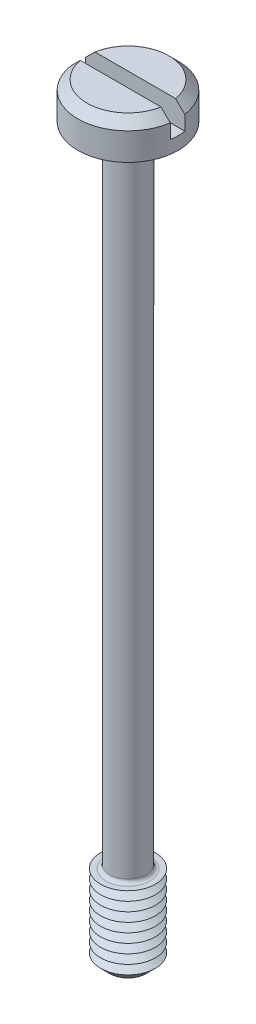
ISO-10303-21;
HEADER;
FILE_DESCRIPTION(('STEP AP214'),'2;1');
FILE_NAME('part.step','',(''),(''),'','','');
FILE_SCHEMA(('AUTOMOTIVE_DESIGN { 1 0 10303 214 1 1 1 1 }'));
ENDSEC;
DATA;
#1=APPLICATION_CONTEXT('core data for automotive mechanical design processes');
#2=APPLICATION_PROTOCOL_DEFINITION('international standard','automotive_design',2000,#1);
#3=PRODUCT_CONTEXT('',#1,'mechanical');
#4=PRODUCT('Part','Part','',(#3));
#5=PRODUCT_RELATED_PRODUCT_CATEGORY('part','',(#4));
#6=PRODUCT_DEFINITION_FORMATION('','',#4);
#7=PRODUCT_DEFINITION_CONTEXT('part definition',#1,'design');
#8=PRODUCT_DEFINITION('design','',#6,#7);
#9=PRODUCT_DEFINITION_SHAPE('','',#8);
#10=(LENGTH_UNIT() NAMED_UNIT(*) SI_UNIT(.MILLI.,.METRE.));
#11=(NAMED_UNIT(*) PLANE_ANGLE_UNIT() SI_UNIT($,.RADIAN.));
#12=(NAMED_UNIT(*) SI_UNIT($,.STERADIAN.) SOLID_ANGLE_UNIT());
#13=UNCERTAINTY_MEASURE_WITH_UNIT(LENGTH_MEASURE(1.E-05),#10,'distance_accuracy_value','');
#14=(GEOMETRIC_REPRESENTATION_CONTEXT(3) GLOBAL_UNCERTAINTY_ASSIGNED_CONTEXT((#13)) GLOBAL_UNIT_ASSIGNED_CONTEXT((#10,
#11,#12)) REPRESENTATION_CONTEXT('',''));
#15=CARTESIAN_POINT('',(0.,0.,0.));
#16=DIRECTION('',(0.,0.,1.));
#17=DIRECTION('',(1.,0.,0.));
#18=AXIS2_PLACEMENT_3D('',#15,#16,#17);
#19=CARTESIAN_POINT('',(0.,2.,0.));
#20=DIRECTION('',(0.,1.,0.));
#21=DIRECTION('',(0.,0.,1.));
#22=AXIS2_PLACEMENT_3D('',#19,#20,#21);
#23=PLANE('',#22);
#24=DIRECTION('',(-1.,0.,0.));
#25=VECTOR('',#24,1.);
#26=CARTESIAN_POINT('',(2.75,2.,-0.4));
#27=LINE('',#26,#25);
#28=CARTESIAN_POINT('',(2.21415898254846,2.,-0.4));
#29=VERTEX_POINT('',#28);
#30=CARTESIAN_POINT('',(-2.21415898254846,2.,-0.4));
#31=VERTEX_POINT('',#30);
#32=EDGE_CURVE('E110',#29,#31,#27,.T.);
#33=ORIENTED_EDGE('',*,*,#32,.F.);
#34=CARTESIAN_POINT('',(0.,2.,0.));
#35=DIRECTION('',(0.,1.,0.));
#36=DIRECTION('',(0.,0.,1.));
#37=AXIS2_PLACEMENT_3D('',#34,#35,#36);
#38=CIRCLE('',#37,2.25000000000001);
#39=EDGE_CURVE('E113',#29,#31,#38,.T.);
#40=ORIENTED_EDGE('',*,*,#39,.T.);
#41=EDGE_LOOP('',(#33,#40));
#42=FACE_BOUND('',#41,.T.);
#43=ADVANCED_FACE('F39',(#42),#23,.T.);
#44=CARTESIAN_POINT('',(0.,2.,0.));
#45=DIRECTION('',(0.,-1.,0.));
#46=DIRECTION('',(0.,0.,-1.));
#47=AXIS2_PLACEMENT_3D('',#44,#45,#46);
#48=CONICAL_SURFACE('',#47,2.25000000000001,0.785398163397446);
#49=CARTESIAN_POINT('',(6.05060089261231,-1.81380830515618,-0.4));
#50=CARTESIAN_POINT('',(5.84217393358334,-1.60583904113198,-0.4));
#51=CARTESIAN_POINT('',(5.63372707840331,-1.39788969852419,-0.4));
#52=CARTESIAN_POINT('',(5.21676338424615,-0.982052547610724,-0.4));
#53=CARTESIAN_POINT('',(5.00824654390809,-0.774164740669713,-0.4));
#54=CARTESIAN_POINT('',(4.59102343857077,-0.358383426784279,-0.4));
#55=CARTESIAN_POINT('',(4.38231713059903,-0.150489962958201,-0.4));
#56=CARTESIAN_POINT('',(3.96477014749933,0.265153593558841,-0.4));
#57=CARTESIAN_POINT('',(3.75592947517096,0.47290368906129,-0.4));
#58=CARTESIAN_POINT('',(3.33589913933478,0.890287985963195,-0.4));
#59=CARTESIAN_POINT('',(3.12470717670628,1.09991987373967,-0.4));
#60=CARTESIAN_POINT('',(2.7019134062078,1.51879562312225,-0.4));
#61=CARTESIAN_POINT('',(2.49031157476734,1.72803946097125,-0.4));
#62=CARTESIAN_POINT('',(2.17231429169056,2.04123939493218,-0.4));
#63=CARTESIAN_POINT('',(2.06623184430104,2.14551302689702,-0.4));
#64=CARTESIAN_POINT('',(1.85373145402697,2.35372301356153,-0.4));
#65=CARTESIAN_POINT('',(1.74731350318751,2.45765936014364,-0.4));
#66=CARTESIAN_POINT('',(1.53394692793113,2.6649644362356,-0.4));
#67=CARTESIAN_POINT('',(1.42699836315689,2.76833322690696,-0.4));
#68=CARTESIAN_POINT('',(1.26580938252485,2.9225823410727,-0.4));
#69=CARTESIAN_POINT('',(1.21195308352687,2.97386371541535,-0.4));
#70=CARTESIAN_POINT('',(1.10386632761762,3.07603025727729,-0.4));
#71=CARTESIAN_POINT('',(1.0496358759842,3.126915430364,-0.4));
#72=CARTESIAN_POINT('',(0.965529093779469,3.20495157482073,-0.4));
#73=CARTESIAN_POINT('',(0.935852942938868,3.23231811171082,-0.4));
#74=CARTESIAN_POINT('',(0.876282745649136,3.2868144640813,-0.4));
#75=CARTESIAN_POINT('',(0.846388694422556,3.31394427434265,-0.4));
#76=CARTESIAN_POINT('',(0.786319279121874,3.36788760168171,-0.4));
#77=CARTESIAN_POINT('',(0.756143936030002,3.39470114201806,-0.4));
#78=CARTESIAN_POINT('',(0.695411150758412,3.44788757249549,-0.4));
#79=CARTESIAN_POINT('',(0.664853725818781,3.47426048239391,-0.4));
#80=CARTESIAN_POINT('',(0.587773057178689,3.53947080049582,-0.4));
#81=CARTESIAN_POINT('',(0.540923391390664,3.57793090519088,-0.4));
#82=CARTESIAN_POINT('',(0.469108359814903,3.63368803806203,-0.4));
#83=CARTESIAN_POINT('',(0.4449029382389,3.65195872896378,-0.4));
#84=CARTESIAN_POINT('',(0.395796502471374,3.68753467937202,-0.4));
#85=CARTESIAN_POINT('',(0.370895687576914,3.70484021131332,-0.4));
#86=CARTESIAN_POINT('',(0.315135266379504,3.74129905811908,-0.4));
#87=CARTESIAN_POINT('',(0.284069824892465,3.76014262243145,-0.4));
#88=CARTESIAN_POINT('',(0.220007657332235,3.79429188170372,-0.4));
#89=CARTESIAN_POINT('',(0.187014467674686,3.80960381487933,-0.4));
#90=CARTESIAN_POINT('',(0.12946932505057,3.83013103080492,-0.4));
#91=CARTESIAN_POINT('',(0.105533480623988,3.83700748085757,-0.4));
#92=CARTESIAN_POINT('',(0.056886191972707,3.84667143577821,-0.4));
#93=CARTESIAN_POINT('',(0.032177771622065,3.84947323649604,-0.4));
#94=CARTESIAN_POINT('',(-0.017455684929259,3.85039131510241,-0.4));
#95=CARTESIAN_POINT('',(-0.0423811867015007,3.84848412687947,-0.4));
#96=CARTESIAN_POINT('',(-0.091546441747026,3.8403829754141,-0.4));
#97=CARTESIAN_POINT('',(-0.11578417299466,3.83417751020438,-0.4));
#98=CARTESIAN_POINT('',(-0.164015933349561,3.81830420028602,-0.4));
#99=CARTESIAN_POINT('',(-0.187969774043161,3.80851974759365,-0.4));
#100=CARTESIAN_POINT('',(-0.234812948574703,3.78663483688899,-0.4));
#101=CARTESIAN_POINT('',(-0.257700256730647,3.77453017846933,-0.4));
#102=CARTESIAN_POINT('',(-0.3027615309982,3.74868049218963,-0.4));
#103=CARTESIAN_POINT('',(-0.324928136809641,3.73492286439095,-0.4));
#104=CARTESIAN_POINT('',(-0.36853632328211,3.70635481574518,-0.4));
#105=CARTESIAN_POINT('',(-0.389978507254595,3.691545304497,-0.4));
#106=CARTESIAN_POINT('',(-0.457169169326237,3.64340388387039,-0.4));
#107=CARTESIAN_POINT('',(-0.501937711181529,3.60871473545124,-0.4));
#108=CARTESIAN_POINT('',(-0.590074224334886,3.53759028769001,-0.4));
#109=CARTESIAN_POINT('',(-0.633441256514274,3.50115385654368,-0.4));
#110=CARTESIAN_POINT('',(-0.719371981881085,3.42718980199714,-0.4));
#111=CARTESIAN_POINT('',(-0.761934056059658,3.3896603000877,-0.4));
#112=CARTESIAN_POINT('',(-0.84646547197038,3.31396862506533,-0.4));
#113=CARTESIAN_POINT('',(-0.888434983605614,3.27580664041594,-0.4));
#114=CARTESIAN_POINT('',(-1.01351008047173,3.16091722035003,-0.4));
#115=CARTESIAN_POINT('',(-1.09603733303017,3.0835613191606,-0.4));
#116=CARTESIAN_POINT('',(-1.26020205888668,2.92809304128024,-0.4));
#117=CARTESIAN_POINT('',(-1.34184039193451,2.84998156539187,-0.4));
#118=CARTESIAN_POINT('',(-1.50425180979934,2.69362860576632,-0.4));
#119=CARTESIAN_POINT('',(-1.58502715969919,2.61538947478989,-0.4));
#120=CARTESIAN_POINT('',(-1.74627332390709,2.45859784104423,-0.4));
#121=CARTESIAN_POINT('',(-1.82674413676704,2.38004533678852,-0.4));
#122=CARTESIAN_POINT('',(-2.06785619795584,2.14407469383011,-0.4));
#123=CARTESIAN_POINT('',(-2.22819388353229,1.98634651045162,-0.4));
#124=CARTESIAN_POINT('',(-2.54852691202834,1.67040441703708,-0.4));
#125=CARTESIAN_POINT('',(-2.70852207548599,1.51219032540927,-0.4));
#126=CARTESIAN_POINT('',(-3.02826273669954,1.19551306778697,-0.4));
#127=CARTESIAN_POINT('',(-3.18800823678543,1.03704990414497,-0.4));
#128=CARTESIAN_POINT('',(-3.66699080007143,0.561455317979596,-0.4));
#129=CARTESIAN_POINT('',(-3.98599924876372,0.244093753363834,-0.4));
#130=CARTESIAN_POINT('',(-4.62369880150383,-0.390879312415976,-0.4));
#131=CARTESIAN_POINT('',(-4.94238993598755,-0.708490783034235,-0.4));
#132=CARTESIAN_POINT('',(-5.39262624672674,-1.15743192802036,-0.4));
#133=CARTESIAN_POINT('',(-5.52423897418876,-1.28869385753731,-0.4));
#134=CARTESIAN_POINT('',(-5.78743776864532,-1.5512369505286,-0.4));
#135=CARTESIAN_POINT('',(-5.91902383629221,-1.68251811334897,-0.4));
#136=CARTESIAN_POINT('',(-6.05060089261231,-1.81380830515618,-0.4));
#137=B_SPLINE_CURVE_WITH_KNOTS('',3,(#49,#50,#51,#52,#53,#54,#55,#56,#57,#58,#59,#60,#61,#62,
#63,#64,#65,#66,#67,#68,#69,#70,#71,#72,#73,#74,#75,#76,#77,#78,#79,#80,#81,#82,#83,#84,#85,#86,
#87,#88,#89,#90,#91,#92,#93,#94,#95,#96,#97,#98,#99,#100,#101,#102,#103,#104,#105,#106,#107,
#108,#109,#110,#111,#112,#113,#114,#115,#116,#117,#118,#119,#120,#121,#122,#123,#124,#125,#126,
#127,#128,#129,#130,#131,#132,#133,#134,#135,#136),.UNSPECIFIED.,.F.,.F.,(4,2,2,2,2,2,2,2,2,2,2,
2,2,2,2,2,2,2,2,2,2,2,2,2,2,2,2,2,2,2,2,2,2,2,2,2,2,2,2,2,2,2,2,4),(0.,0.883310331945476,
1.76663897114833,2.65038219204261,3.53410755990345,4.42681573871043,5.31957687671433,
5.76582544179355,6.21208466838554,6.65829482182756,6.88139126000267,7.10448455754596,
7.22558850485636,7.34669511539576,7.46779276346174,7.58888496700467,7.77066509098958,
7.86163037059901,7.95256984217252,8.06146372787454,8.17016376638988,8.24461141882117,
8.31879723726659,8.39335348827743,8.46811002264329,8.54555790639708,8.62314734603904,
8.70137101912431,8.77952785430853,8.94932745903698,9.1192385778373,9.28946128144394,
9.45963414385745,9.79895964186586,10.1379210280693,10.475282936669,10.8126464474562,
11.4873867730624,12.1624208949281,12.8374486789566,14.1873973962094,15.5372009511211,
16.0948428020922,16.6524687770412),.UNSPECIFIED.);
#138=CARTESIAN_POINT('',(2.72075357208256,1.5,-0.4));
#139=VERTEX_POINT('',#138);
#140=EDGE_CURVE('E259',#139,#29,#137,.T.);
#141=ORIENTED_EDGE('',*,*,#140,.F.);
#142=CARTESIAN_POINT('',(0.,1.5,0.));
#143=DIRECTION('',(0.,1.,0.));
#144=DIRECTION('',(0.,0.,1.));
#145=AXIS2_PLACEMENT_3D('',#142,#143,#144);
#146=CIRCLE('',#145,2.75);
#147=CARTESIAN_POINT('',(-2.72075357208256,1.5,-0.4));
#148=VERTEX_POINT('',#147);
#149=EDGE_CURVE('E127',#148,#139,#146,.F.);
#150=ORIENTED_EDGE('',*,*,#149,.F.);
#151=EDGE_CURVE('E102',#31,#148,#137,.T.);
#152=ORIENTED_EDGE('',*,*,#151,.F.);
#153=ORIENTED_EDGE('',*,*,#39,.F.);
#154=EDGE_LOOP('',(#141,#150,#152,#153));
#155=FACE_BOUND('',#154,.T.);
#156=ADVANCED_FACE('F221',(#155),#48,.T.);
#157=CARTESIAN_POINT('',(0.,-40.,0.));
#158=DIRECTION('',(0.,1.,0.));
#159=DIRECTION('',(0.,0.,1.));
#160=AXIS2_PLACEMENT_3D('',#157,#158,#159);
#161=CYLINDRICAL_SURFACE('',#160,1.);
#162=CARTESIAN_POINT('',(0.,-35.3,0.));
#163=DIRECTION('',(0.,-1.,0.));
#164=DIRECTION('',(0.,0.,-1.));
#165=AXIS2_PLACEMENT_3D('',#162,#163,#164);
#166=CIRCLE('',#165,1.);
#167=CARTESIAN_POINT('',(0.,-35.3,-1.));
#168=VERTEX_POINT('',#167);
#169=EDGE_CURVE('E122',#168,#168,#166,.F.);
#170=ORIENTED_EDGE('',*,*,#169,.T.);
#171=EDGE_LOOP('',(#170));
#172=FACE_BOUND('',#171,.T.);
#173=CARTESIAN_POINT('',(0.,-0.199999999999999,0.));
#174=DIRECTION('',(0.,1.,0.));
#175=DIRECTION('',(0.,0.,1.));
#176=AXIS2_PLACEMENT_3D('',#173,#174,#175);
#177=CIRCLE('',#176,1.);
#178=CARTESIAN_POINT('',(0.,-0.199999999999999,1.));
#179=VERTEX_POINT('',#178);
#180=EDGE_CURVE('E366',#179,#179,#177,.F.);
#181=ORIENTED_EDGE('',*,*,#180,.T.);
#182=EDGE_LOOP('',(#181));
#183=FACE_BOUND('',#182,.T.);
#184=ADVANCED_FACE('F217',(#172,#183),#161,.T.);
#185=CARTESIAN_POINT('',(0.,2.,0.));
#186=DIRECTION('',(0.,-1.,0.));
#187=DIRECTION('',(0.,0.,-1.));
#188=AXIS2_PLACEMENT_3D('',#185,#186,#187);
#189=CYLINDRICAL_SURFACE('',#188,2.75);
#190=ORIENTED_EDGE('',*,*,#149,.T.);
#191=DIRECTION('',(0.,-1.,0.));
#192=VECTOR('',#191,1.);
#193=CARTESIAN_POINT('',(2.72075357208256,2.,-0.4));
#194=LINE('',#193,#192);
#195=CARTESIAN_POINT('',(2.72075357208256,0.7,-0.4));
#196=VERTEX_POINT('',#195);
#197=EDGE_CURVE('E64',#139,#196,#194,.T.);
#198=ORIENTED_EDGE('',*,*,#197,.T.);
#199=CARTESIAN_POINT('',(0.,0.7,0.));
#200=DIRECTION('',(0.,1.,0.));
#201=DIRECTION('',(0.,0.,1.));
#202=AXIS2_PLACEMENT_3D('',#199,#200,#201);
#203=CIRCLE('',#202,2.75);
#204=CARTESIAN_POINT('',(2.72075357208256,0.7,0.4));
#205=VERTEX_POINT('',#204);
#206=EDGE_CURVE('E11',#205,#196,#203,.T.);
#207=ORIENTED_EDGE('',*,*,#206,.F.);
#208=DIRECTION('',(0.,-1.,0.));
#209=VECTOR('',#208,1.);
#210=CARTESIAN_POINT('',(2.72075357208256,2.,0.4));
#211=LINE('',#210,#209);
#212=CARTESIAN_POINT('',(2.72075357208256,1.5,0.4));
#213=VERTEX_POINT('',#212);
#214=EDGE_CURVE('E277',#205,#213,#211,.F.);
#215=ORIENTED_EDGE('',*,*,#214,.T.);
#216=CARTESIAN_POINT('',(-2.72075357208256,1.5,0.4));
#217=VERTEX_POINT('',#216);
#218=EDGE_CURVE('E120',#213,#217,#146,.F.);
#219=ORIENTED_EDGE('',*,*,#218,.T.);
#220=DIRECTION('',(0.,-1.,0.));
#221=VECTOR('',#220,1.);
#222=CARTESIAN_POINT('',(-2.72075357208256,2.,0.4));
#223=LINE('',#222,#221);
#224=CARTESIAN_POINT('',(-2.72075357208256,0.7,0.4));
#225=VERTEX_POINT('',#224);
#226=EDGE_CURVE('E96',#217,#225,#223,.T.);
#227=ORIENTED_EDGE('',*,*,#226,.T.);
#228=CARTESIAN_POINT('',(-2.72075357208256,0.7,-0.4));
#229=VERTEX_POINT('',#228);
#230=EDGE_CURVE('E44',#229,#225,#203,.T.);
#231=ORIENTED_EDGE('',*,*,#230,.F.);
#232=DIRECTION('',(0.,-1.,0.));
#233=VECTOR('',#232,1.);
#234=CARTESIAN_POINT('',(-2.72075357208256,2.,-0.4));
#235=LINE('',#234,#233);
#236=EDGE_CURVE('E282',#229,#148,#235,.F.);
#237=ORIENTED_EDGE('',*,*,#236,.T.);
#238=EDGE_LOOP('',(#190,#198,#207,#215,#219,#227,#231,#237));
#239=FACE_BOUND('',#238,.T.);
#240=CARTESIAN_POINT('',(0.,0.,0.));
#241=DIRECTION('',(0.,1.,0.));
#242=DIRECTION('',(0.,0.,1.));
#243=AXIS2_PLACEMENT_3D('',#240,#241,#242);
#244=CIRCLE('',#243,2.75);
#245=CARTESIAN_POINT('',(0.,0.,2.75));
#246=VERTEX_POINT('',#245);
#247=EDGE_CURVE('E355',#246,#246,#244,.T.);
#248=ORIENTED_EDGE('',*,*,#247,.T.);
#249=EDGE_LOOP('',(#248));
#250=FACE_BOUND('',#249,.T.);
#251=ADVANCED_FACE('F220',(#239,#250),#189,.T.);
#252=DIRECTION('',(1.,0.,0.));
#253=VECTOR('',#252,1.);
#254=CARTESIAN_POINT('',(2.75,2.,0.4));
#255=LINE('',#254,#253);
#256=CARTESIAN_POINT('',(-2.21415898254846,2.,0.4));
#257=VERTEX_POINT('',#256);
#258=CARTESIAN_POINT('',(2.21415898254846,2.,0.4));
#259=VERTEX_POINT('',#258);
#260=EDGE_CURVE('E56',#257,#259,#255,.T.);
#261=ORIENTED_EDGE('',*,*,#260,.F.);
#262=EDGE_CURVE('E108',#257,#259,#38,.T.);
#263=ORIENTED_EDGE('',*,*,#262,.T.);
#264=EDGE_LOOP('',(#261,#263));
#265=FACE_BOUND('',#264,.T.);
#266=ADVANCED_FACE('F107',(#265),#23,.T.);
#267=CARTESIAN_POINT('',(0.,0.,0.));
#268=DIRECTION('',(0.,1.,0.));
#269=DIRECTION('',(0.,0.,1.));
#270=AXIS2_PLACEMENT_3D('',#267,#268,#269);
#271=PLANE('',#270);
#272=CARTESIAN_POINT('',(0.,0.,0.));
#273=DIRECTION('',(0.,1.,0.));
#274=DIRECTION('',(0.,0.,1.));
#275=AXIS2_PLACEMENT_3D('',#272,#273,#274);
#276=CIRCLE('',#275,1.2);
#277=CARTESIAN_POINT('',(0.,0.,1.2));
#278=VERTEX_POINT('',#277);
#279=EDGE_CURVE('E114',#278,#278,#276,.T.);
#280=ORIENTED_EDGE('',*,*,#279,.T.);
#281=EDGE_LOOP('',(#280));
#282=FACE_BOUND('',#281,.T.);
#283=ORIENTED_EDGE('',*,*,#247,.F.);
#284=EDGE_LOOP('',(#283));
#285=FACE_BOUND('',#284,.T.);
#286=ADVANCED_FACE('F211',(#282,#285),#271,.F.);
#287=CARTESIAN_POINT('',(0.,-35.5,0.));
#288=DIRECTION('',(0.,-1.,0.));
#289=DIRECTION('',(0.,0.,-1.));
#290=AXIS2_PLACEMENT_3D('',#287,#288,#289);
#291=PLANE('',#290);
#292=CARTESIAN_POINT('',(0.,-35.5,0.));
#293=DIRECTION('',(0.,-1.,0.));
#294=DIRECTION('',(0.,0.,-1.));
#295=AXIS2_PLACEMENT_3D('',#292,#293,#294);
#296=CIRCLE('',#295,1.2);
#297=CARTESIAN_POINT('',(0.,-35.5,-1.2));
#298=VERTEX_POINT('',#297);
#299=EDGE_CURVE('E362',#298,#298,#296,.T.);
#300=ORIENTED_EDGE('',*,*,#299,.T.);
#301=EDGE_LOOP('',(#300));
#302=FACE_BOUND('',#301,.T.);
#303=CARTESIAN_POINT('',(0.,-35.5,0.));
#304=DIRECTION('',(0.,1.,0.));
#305=DIRECTION('',(0.,0.,1.));
#306=AXIS2_PLACEMENT_3D('',#303,#304,#305);
#307=CIRCLE('',#306,1.5);
#308=CARTESIAN_POINT('',(0.,-35.5,1.5));
#309=VERTEX_POINT('',#308);
#310=EDGE_CURVE('E351',#309,#309,#307,.T.);
#311=ORIENTED_EDGE('',*,*,#310,.T.);
#312=EDGE_LOOP('',(#311));
#313=FACE_BOUND('',#312,.T.);
#314=ADVANCED_FACE('F207',(#302,#313),#291,.F.);
#315=CARTESIAN_POINT('',(0.,-35.75,0.));
#316=DIRECTION('',(0.,1.,0.));
#317=DIRECTION('',(0.,0.,1.));
#318=AXIS2_PLACEMENT_3D('',#315,#316,#317);
#319=CONICAL_SURFACE('',#318,1.06698729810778,1.0471975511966);
#320=ORIENTED_EDGE('',*,*,#310,.F.);
#321=EDGE_LOOP('',(#320));
#322=FACE_BOUND('',#321,.T.);
#323=CARTESIAN_POINT('',(0.,-35.75,0.));
#324=DIRECTION('',(0.,1.,0.));
#325=DIRECTION('',(0.,0.,1.));
#326=AXIS2_PLACEMENT_3D('',#323,#324,#325);
#327=CIRCLE('',#326,1.06698729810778);
#328=CARTESIAN_POINT('',(0.,-35.75,1.06698729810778));
#329=VERTEX_POINT('',#328);
#330=EDGE_CURVE('E348',#329,#329,#327,.T.);
#331=ORIENTED_EDGE('',*,*,#330,.T.);
#332=EDGE_LOOP('',(#331));
#333=FACE_BOUND('',#332,.T.);
#334=ADVANCED_FACE('F203',(#322,#333),#319,.T.);
#335=CARTESIAN_POINT('',(0.,-36.,0.));
#336=DIRECTION('',(0.,-1.,0.));
#337=DIRECTION('',(0.,0.,-1.));
#338=AXIS2_PLACEMENT_3D('',#335,#336,#337);
#339=CONICAL_SURFACE('',#338,1.5,1.0471975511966);
#340=ORIENTED_EDGE('',*,*,#330,.F.);
#341=EDGE_LOOP('',(#340));
#342=FACE_BOUND('',#341,.T.);
#343=CARTESIAN_POINT('',(0.,-36.,0.));
#344=DIRECTION('',(0.,1.,0.));
#345=DIRECTION('',(0.,0.,1.));
#346=AXIS2_PLACEMENT_3D('',#343,#344,#345);
#347=CIRCLE('',#346,1.5);
#348=CARTESIAN_POINT('',(0.,-36.,1.5));
#349=VERTEX_POINT('',#348);
#350=EDGE_CURVE('E345',#349,#349,#347,.T.);
#351=ORIENTED_EDGE('',*,*,#350,.T.);
#352=EDGE_LOOP('',(#351));
#353=FACE_BOUND('',#352,.T.);
#354=ADVANCED_FACE('F199',(#342,#353),#339,.T.);
#355=CARTESIAN_POINT('',(0.,-36.25,0.));
#356=DIRECTION('',(0.,1.,0.));
#357=DIRECTION('',(0.,0.,1.));
#358=AXIS2_PLACEMENT_3D('',#355,#356,#357);
#359=CONICAL_SURFACE('',#358,1.06698729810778,1.0471975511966);
#360=ORIENTED_EDGE('',*,*,#350,.F.);
#361=EDGE_LOOP('',(#360));
#362=FACE_BOUND('',#361,.T.);
#363=CARTESIAN_POINT('',(0.,-36.25,0.));
#364=DIRECTION('',(0.,1.,0.));
#365=DIRECTION('',(0.,0.,1.));
#366=AXIS2_PLACEMENT_3D('',#363,#364,#365);
#367=CIRCLE('',#366,1.06698729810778);
#368=CARTESIAN_POINT('',(0.,-36.25,1.06698729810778));
#369=VERTEX_POINT('',#368);
#370=EDGE_CURVE('E341',#369,#369,#367,.T.);
#371=ORIENTED_EDGE('',*,*,#370,.T.);
#372=EDGE_LOOP('',(#371));
#373=FACE_BOUND('',#372,.T.);
#374=ADVANCED_FACE('F195',(#362,#373),#359,.T.);
#375=CARTESIAN_POINT('',(0.,-36.5,0.));
#376=DIRECTION('',(0.,-1.,0.));
#377=DIRECTION('',(0.,0.,-1.));
#378=AXIS2_PLACEMENT_3D('',#375,#376,#377);
#379=CONICAL_SURFACE('',#378,1.5,1.0471975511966);
#380=ORIENTED_EDGE('',*,*,#370,.F.);
#381=EDGE_LOOP('',(#380));
#382=FACE_BOUND('',#381,.T.);
#383=CARTESIAN_POINT('',(0.,-36.5,0.));
#384=DIRECTION('',(0.,1.,0.));
#385=DIRECTION('',(0.,0.,1.));
#386=AXIS2_PLACEMENT_3D('',#383,#384,#385);
#387=CIRCLE('',#386,1.5);
#388=CARTESIAN_POINT('',(0.,-36.5,1.5));
#389=VERTEX_POINT('',#388);
#390=EDGE_CURVE('E337',#389,#389,#387,.T.);
#391=ORIENTED_EDGE('',*,*,#390,.T.);
#392=EDGE_LOOP('',(#391));
#393=FACE_BOUND('',#392,.T.);
#394=ADVANCED_FACE('F191',(#382,#393),#379,.T.);
#395=CARTESIAN_POINT('',(0.,-36.75,0.));
#396=DIRECTION('',(0.,1.,0.));
#397=DIRECTION('',(0.,0.,1.));
#398=AXIS2_PLACEMENT_3D('',#395,#396,#397);
#399=CONICAL_SURFACE('',#398,1.06698729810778,1.0471975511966);
#400=ORIENTED_EDGE('',*,*,#390,.F.);
#401=EDGE_LOOP('',(#400));
#402=FACE_BOUND('',#401,.T.);
#403=CARTESIAN_POINT('',(0.,-36.75,0.));
#404=DIRECTION('',(0.,1.,0.));
#405=DIRECTION('',(0.,0.,1.));
#406=AXIS2_PLACEMENT_3D('',#403,#404,#405);
#407=CIRCLE('',#406,1.06698729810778);
#408=CARTESIAN_POINT('',(0.,-36.75,1.06698729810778));
#409=VERTEX_POINT('',#408);
#410=EDGE_CURVE('E333',#409,#409,#407,.T.);
#411=ORIENTED_EDGE('',*,*,#410,.T.);
#412=EDGE_LOOP('',(#411));
#413=FACE_BOUND('',#412,.T.);
#414=ADVANCED_FACE('F187',(#402,#413),#399,.T.);
#415=CARTESIAN_POINT('',(0.,-37.,0.));
#416=DIRECTION('',(0.,-1.,0.));
#417=DIRECTION('',(0.,0.,-1.));
#418=AXIS2_PLACEMENT_3D('',#415,#416,#417);
#419=CONICAL_SURFACE('',#418,1.5,1.0471975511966);
#420=ORIENTED_EDGE('',*,*,#410,.F.);
#421=EDGE_LOOP('',(#420));
#422=FACE_BOUND('',#421,.T.);
#423=CARTESIAN_POINT('',(0.,-37.,0.));
#424=DIRECTION('',(0.,1.,0.));
#425=DIRECTION('',(0.,0.,1.));
#426=AXIS2_PLACEMENT_3D('',#423,#424,#425);
#427=CIRCLE('',#426,1.5);
#428=CARTESIAN_POINT('',(0.,-37.,1.5));
#429=VERTEX_POINT('',#428);
#430=EDGE_CURVE('E330',#429,#429,#427,.T.);
#431=ORIENTED_EDGE('',*,*,#430,.T.);
#432=EDGE_LOOP('',(#431));
#433=FACE_BOUND('',#432,.T.);
#434=ADVANCED_FACE('F183',(#422,#433),#419,.T.);
#435=CARTESIAN_POINT('',(0.,-37.25,0.));
#436=DIRECTION('',(0.,1.,0.));
#437=DIRECTION('',(0.,0.,1.));
#438=AXIS2_PLACEMENT_3D('',#435,#436,#437);
#439=CONICAL_SURFACE('',#438,1.06698729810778,1.0471975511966);
#440=ORIENTED_EDGE('',*,*,#430,.F.);
#441=EDGE_LOOP('',(#440));
#442=FACE_BOUND('',#441,.T.);
#443=CARTESIAN_POINT('',(0.,-37.25,0.));
#444=DIRECTION('',(0.,1.,0.));
#445=DIRECTION('',(0.,0.,1.));
#446=AXIS2_PLACEMENT_3D('',#443,#444,#445);
#447=CIRCLE('',#446,1.06698729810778);
#448=CARTESIAN_POINT('',(0.,-37.25,1.06698729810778));
#449=VERTEX_POINT('',#448);
#450=EDGE_CURVE('E326',#449,#449,#447,.T.);
#451=ORIENTED_EDGE('',*,*,#450,.T.);
#452=EDGE_LOOP('',(#451));
#453=FACE_BOUND('',#452,.T.);
#454=ADVANCED_FACE('F179',(#442,#453),#439,.T.);
#455=CARTESIAN_POINT('',(0.,-37.5,0.));
#456=DIRECTION('',(0.,-1.,0.));
#457=DIRECTION('',(0.,0.,-1.));
#458=AXIS2_PLACEMENT_3D('',#455,#456,#457);
#459=CONICAL_SURFACE('',#458,1.5,1.0471975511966);
#460=ORIENTED_EDGE('',*,*,#450,.F.);
#461=EDGE_LOOP('',(#460));
#462=FACE_BOUND('',#461,.T.);
#463=CARTESIAN_POINT('',(0.,-37.5,0.));
#464=DIRECTION('',(0.,1.,0.));
#465=DIRECTION('',(0.,0.,1.));
#466=AXIS2_PLACEMENT_3D('',#463,#464,#465);
#467=CIRCLE('',#466,1.5);
#468=CARTESIAN_POINT('',(0.,-37.5,1.5));
#469=VERTEX_POINT('',#468);
#470=EDGE_CURVE('E323',#469,#469,#467,.T.);
#471=ORIENTED_EDGE('',*,*,#470,.T.);
#472=EDGE_LOOP('',(#471));
#473=FACE_BOUND('',#472,.T.);
#474=ADVANCED_FACE('F175',(#462,#473),#459,.T.);
#475=CARTESIAN_POINT('',(0.,-37.75,0.));
#476=DIRECTION('',(0.,1.,0.));
#477=DIRECTION('',(0.,0.,1.));
#478=AXIS2_PLACEMENT_3D('',#475,#476,#477);
#479=CONICAL_SURFACE('',#478,1.06698729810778,1.0471975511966);
#480=ORIENTED_EDGE('',*,*,#470,.F.);
#481=EDGE_LOOP('',(#480));
#482=FACE_BOUND('',#481,.T.);
#483=CARTESIAN_POINT('',(0.,-37.75,0.));
#484=DIRECTION('',(0.,1.,0.));
#485=DIRECTION('',(0.,0.,1.));
#486=AXIS2_PLACEMENT_3D('',#483,#484,#485);
#487=CIRCLE('',#486,1.06698729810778);
#488=CARTESIAN_POINT('',(0.,-37.75,1.06698729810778));
#489=VERTEX_POINT('',#488);
#490=EDGE_CURVE('E319',#489,#489,#487,.T.);
#491=ORIENTED_EDGE('',*,*,#490,.T.);
#492=EDGE_LOOP('',(#491));
#493=FACE_BOUND('',#492,.T.);
#494=ADVANCED_FACE('F171',(#482,#493),#479,.T.);
#495=CARTESIAN_POINT('',(0.,-38.,0.));
#496=DIRECTION('',(0.,-1.,0.));
#497=DIRECTION('',(0.,0.,-1.));
#498=AXIS2_PLACEMENT_3D('',#495,#496,#497);
#499=CONICAL_SURFACE('',#498,1.5,1.0471975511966);
#500=ORIENTED_EDGE('',*,*,#490,.F.);
#501=EDGE_LOOP('',(#500));
#502=FACE_BOUND('',#501,.T.);
#503=CARTESIAN_POINT('',(0.,-38.,0.));
#504=DIRECTION('',(0.,1.,0.));
#505=DIRECTION('',(0.,0.,1.));
#506=AXIS2_PLACEMENT_3D('',#503,#504,#505);
#507=CIRCLE('',#506,1.5);
#508=CARTESIAN_POINT('',(0.,-38.,1.5));
#509=VERTEX_POINT('',#508);
#510=EDGE_CURVE('E315',#509,#509,#507,.T.);
#511=ORIENTED_EDGE('',*,*,#510,.T.);
#512=EDGE_LOOP('',(#511));
#513=FACE_BOUND('',#512,.T.);
#514=ADVANCED_FACE('F167',(#502,#513),#499,.T.);
#515=CARTESIAN_POINT('',(0.,-38.25,0.));
#516=DIRECTION('',(0.,1.,0.));
#517=DIRECTION('',(0.,0.,1.));
#518=AXIS2_PLACEMENT_3D('',#515,#516,#517);
#519=CONICAL_SURFACE('',#518,1.06698729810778,1.0471975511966);
#520=ORIENTED_EDGE('',*,*,#510,.F.);
#521=EDGE_LOOP('',(#520));
#522=FACE_BOUND('',#521,.T.);
#523=CARTESIAN_POINT('',(0.,-38.25,0.));
#524=DIRECTION('',(0.,1.,0.));
#525=DIRECTION('',(0.,0.,1.));
#526=AXIS2_PLACEMENT_3D('',#523,#524,#525);
#527=CIRCLE('',#526,1.06698729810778);
#528=CARTESIAN_POINT('',(0.,-38.25,1.06698729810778));
#529=VERTEX_POINT('',#528);
#530=EDGE_CURVE('E311',#529,#529,#527,.T.);
#531=ORIENTED_EDGE('',*,*,#530,.T.);
#532=EDGE_LOOP('',(#531));
#533=FACE_BOUND('',#532,.T.);
#534=ADVANCED_FACE('F163',(#522,#533),#519,.T.);
#535=CARTESIAN_POINT('',(0.,-38.5,0.));
#536=DIRECTION('',(0.,-1.,0.));
#537=DIRECTION('',(0.,0.,-1.));
#538=AXIS2_PLACEMENT_3D('',#535,#536,#537);
#539=CONICAL_SURFACE('',#538,1.5,1.0471975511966);
#540=ORIENTED_EDGE('',*,*,#530,.F.);
#541=EDGE_LOOP('',(#540));
#542=FACE_BOUND('',#541,.T.);
#543=CARTESIAN_POINT('',(0.,-38.5,0.));
#544=DIRECTION('',(0.,1.,0.));
#545=DIRECTION('',(0.,0.,1.));
#546=AXIS2_PLACEMENT_3D('',#543,#544,#545);
#547=CIRCLE('',#546,1.5);
#548=CARTESIAN_POINT('',(0.,-38.5,1.5));
#549=VERTEX_POINT('',#548);
#550=EDGE_CURVE('E307',#549,#549,#547,.T.);
#551=ORIENTED_EDGE('',*,*,#550,.T.);
#552=EDGE_LOOP('',(#551));
#553=FACE_BOUND('',#552,.T.);
#554=ADVANCED_FACE('F159',(#542,#553),#539,.T.);
#555=CARTESIAN_POINT('',(0.,-38.75,0.));
#556=DIRECTION('',(0.,1.,0.));
#557=DIRECTION('',(0.,0.,1.));
#558=AXIS2_PLACEMENT_3D('',#555,#556,#557);
#559=CONICAL_SURFACE('',#558,1.06698729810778,1.0471975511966);
#560=ORIENTED_EDGE('',*,*,#550,.F.);
#561=EDGE_LOOP('',(#560));
#562=FACE_BOUND('',#561,.T.);
#563=CARTESIAN_POINT('',(0.,-38.75,0.));
#564=DIRECTION('',(0.,1.,0.));
#565=DIRECTION('',(0.,0.,1.));
#566=AXIS2_PLACEMENT_3D('',#563,#564,#565);
#567=CIRCLE('',#566,1.06698729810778);
#568=CARTESIAN_POINT('',(0.,-38.75,1.06698729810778));
#569=VERTEX_POINT('',#568);
#570=EDGE_CURVE('E303',#569,#569,#567,.T.);
#571=ORIENTED_EDGE('',*,*,#570,.T.);
#572=EDGE_LOOP('',(#571));
#573=FACE_BOUND('',#572,.T.);
#574=ADVANCED_FACE('F155',(#562,#573),#559,.T.);
#575=CARTESIAN_POINT('',(0.,-39.,0.));
#576=DIRECTION('',(0.,-1.,0.));
#577=DIRECTION('',(0.,0.,-1.));
#578=AXIS2_PLACEMENT_3D('',#575,#576,#577);
#579=CONICAL_SURFACE('',#578,1.5,1.0471975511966);
#580=ORIENTED_EDGE('',*,*,#570,.F.);
#581=EDGE_LOOP('',(#580));
#582=FACE_BOUND('',#581,.T.);
#583=CARTESIAN_POINT('',(0.,-39.,0.));
#584=DIRECTION('',(0.,1.,0.));
#585=DIRECTION('',(0.,0.,1.));
#586=AXIS2_PLACEMENT_3D('',#583,#584,#585);
#587=CIRCLE('',#586,1.5);
#588=CARTESIAN_POINT('',(0.,-39.,1.5));
#589=VERTEX_POINT('',#588);
#590=EDGE_CURVE('E299',#589,#589,#587,.T.);
#591=ORIENTED_EDGE('',*,*,#590,.T.);
#592=EDGE_LOOP('',(#591));
#593=FACE_BOUND('',#592,.T.);
#594=ADVANCED_FACE('F151',(#582,#593),#579,.T.);
#595=CARTESIAN_POINT('',(0.,-39.25,0.));
#596=DIRECTION('',(0.,1.,0.));
#597=DIRECTION('',(0.,0.,1.));
#598=AXIS2_PLACEMENT_3D('',#595,#596,#597);
#599=CONICAL_SURFACE('',#598,1.06698729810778,1.0471975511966);
#600=ORIENTED_EDGE('',*,*,#590,.F.);
#601=EDGE_LOOP('',(#600));
#602=FACE_BOUND('',#601,.T.);
#603=CARTESIAN_POINT('',(0.,-39.25,0.));
#604=DIRECTION('',(0.,1.,0.));
#605=DIRECTION('',(0.,0.,1.));
#606=AXIS2_PLACEMENT_3D('',#603,#604,#605);
#607=CIRCLE('',#606,1.06698729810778);
#608=CARTESIAN_POINT('',(0.,-39.25,1.06698729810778));
#609=VERTEX_POINT('',#608);
#610=EDGE_CURVE('E295',#609,#609,#607,.T.);
#611=ORIENTED_EDGE('',*,*,#610,.T.);
#612=EDGE_LOOP('',(#611));
#613=FACE_BOUND('',#612,.T.);
#614=ADVANCED_FACE('F147',(#602,#613),#599,.T.);
#615=CARTESIAN_POINT('',(0.,-39.5,0.));
#616=DIRECTION('',(0.,-1.,0.));
#617=DIRECTION('',(0.,0.,-1.));
#618=AXIS2_PLACEMENT_3D('',#615,#616,#617);
#619=CONICAL_SURFACE('',#618,1.5,1.0471975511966);
#620=ORIENTED_EDGE('',*,*,#610,.F.);
#621=EDGE_LOOP('',(#620));
#622=FACE_BOUND('',#621,.T.);
#623=CARTESIAN_POINT('',(0.,-39.5,0.));
#624=DIRECTION('',(0.,1.,0.));
#625=DIRECTION('',(0.,0.,1.));
#626=AXIS2_PLACEMENT_3D('',#623,#624,#625);
#627=CIRCLE('',#626,1.5);
#628=CARTESIAN_POINT('',(0.,-39.5,1.5));
#629=VERTEX_POINT('',#628);
#630=EDGE_CURVE('E292',#629,#629,#627,.T.);
#631=ORIENTED_EDGE('',*,*,#630,.T.);
#632=EDGE_LOOP('',(#631));
#633=FACE_BOUND('',#632,.T.);
#634=ADVANCED_FACE('F143',(#622,#633),#619,.T.);
#635=CARTESIAN_POINT('',(0.,-40.,0.));
#636=DIRECTION('',(0.,-1.,0.));
#637=DIRECTION('',(0.,0.,-1.));
#638=AXIS2_PLACEMENT_3D('',#635,#636,#637);
#639=PLANE('',#638);
#640=CARTESIAN_POINT('',(0.,-40.,0.));
#641=DIRECTION('',(0.,-1.,0.));
#642=DIRECTION('',(0.,0.,-1.));
#643=AXIS2_PLACEMENT_3D('',#640,#641,#642);
#644=CIRCLE('',#643,1.00000000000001);
#645=CARTESIAN_POINT('',(0.,-40.,-1.00000000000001));
#646=VERTEX_POINT('',#645);
#647=EDGE_CURVE('E359',#646,#646,#644,.T.);
#648=ORIENTED_EDGE('',*,*,#647,.T.);
#649=EDGE_LOOP('',(#648));
#650=FACE_BOUND('',#649,.T.);
#651=ADVANCED_FACE('F146',(#650),#639,.T.);
#652=CARTESIAN_POINT('',(0.,-40.,0.));
#653=DIRECTION('',(0.,1.,0.));
#654=DIRECTION('',(0.,0.,1.));
#655=AXIS2_PLACEMENT_3D('',#652,#653,#654);
#656=CONICAL_SURFACE('',#655,1.00000000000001,0.785398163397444);
#657=ORIENTED_EDGE('',*,*,#630,.F.);
#658=EDGE_LOOP('',(#657));
#659=FACE_BOUND('',#658,.T.);
#660=ORIENTED_EDGE('',*,*,#647,.F.);
#661=EDGE_LOOP('',(#660));
#662=FACE_BOUND('',#661,.T.);
#663=ADVANCED_FACE('F215',(#659,#662),#656,.T.);
#664=CARTESIAN_POINT('',(0.,-35.3,0.));
#665=DIRECTION('',(0.,-1.,0.));
#666=DIRECTION('',(0.,0.,-1.));
#667=AXIS2_PLACEMENT_3D('',#664,#665,#666);
#668=TOROIDAL_SURFACE('',#667,1.2,0.2);
#669=ORIENTED_EDGE('',*,*,#169,.F.);
#670=EDGE_LOOP('',(#669));
#671=FACE_BOUND('',#670,.T.);
#672=ORIENTED_EDGE('',*,*,#299,.F.);
#673=EDGE_LOOP('',(#672));
#674=FACE_BOUND('',#673,.T.);
#675=ADVANCED_FACE('F233',(#671,#674),#668,.F.);
#676=CARTESIAN_POINT('',(0.,-0.199999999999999,0.));
#677=DIRECTION('',(0.,1.,0.));
#678=DIRECTION('',(0.,0.,1.));
#679=AXIS2_PLACEMENT_3D('',#676,#677,#678);
#680=TOROIDAL_SURFACE('',#679,1.2,0.2);
#681=ORIENTED_EDGE('',*,*,#279,.F.);
#682=EDGE_LOOP('',(#681));
#683=FACE_BOUND('',#682,.T.);
#684=ORIENTED_EDGE('',*,*,#180,.F.);
#685=EDGE_LOOP('',(#684));
#686=FACE_BOUND('',#685,.T.);
#687=ADVANCED_FACE('F236',(#683,#686),#680,.F.);
#688=CARTESIAN_POINT('',(-6.05060089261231,-1.81380830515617,0.4));
#689=CARTESIAN_POINT('',(-5.84217393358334,-1.60583904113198,0.4));
#690=CARTESIAN_POINT('',(-5.63372707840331,-1.39788969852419,0.4));
#691=CARTESIAN_POINT('',(-5.21676338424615,-0.982052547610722,0.4));
#692=CARTESIAN_POINT('',(-5.00824654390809,-0.77416474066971,0.4));
#693=CARTESIAN_POINT('',(-4.59102343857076,-0.358383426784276,0.4));
#694=CARTESIAN_POINT('',(-4.38231713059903,-0.150489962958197,0.4));
#695=CARTESIAN_POINT('',(-3.96477014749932,0.265153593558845,0.4));
#696=CARTESIAN_POINT('',(-3.75592947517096,0.472903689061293,0.4));
#697=CARTESIAN_POINT('',(-3.33589913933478,0.890287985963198,0.4));
#698=CARTESIAN_POINT('',(-3.12470717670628,1.09991987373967,0.4));
#699=CARTESIAN_POINT('',(-2.7019134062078,1.51879562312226,0.4));
#700=CARTESIAN_POINT('',(-2.49031157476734,1.72803946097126,0.4));
#701=CARTESIAN_POINT('',(-2.17231429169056,2.04123939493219,0.4));
#702=CARTESIAN_POINT('',(-2.06623184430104,2.14551302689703,0.4));
#703=CARTESIAN_POINT('',(-1.85373145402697,2.35372301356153,0.4));
#704=CARTESIAN_POINT('',(-1.74731350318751,2.45765936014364,0.4));
#705=CARTESIAN_POINT('',(-1.53394692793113,2.6649644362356,0.4));
#706=CARTESIAN_POINT('',(-1.42699836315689,2.76833322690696,0.4));
#707=CARTESIAN_POINT('',(-1.26580938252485,2.9225823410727,0.4));
#708=CARTESIAN_POINT('',(-1.21195308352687,2.97386371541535,0.4));
#709=CARTESIAN_POINT('',(-1.10386632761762,3.07603025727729,0.4));
#710=CARTESIAN_POINT('',(-1.0496358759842,3.126915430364,0.4));
#711=CARTESIAN_POINT('',(-0.965529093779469,3.20495157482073,0.4));
#712=CARTESIAN_POINT('',(-0.935852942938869,3.23231811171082,0.4));
#713=CARTESIAN_POINT('',(-0.876282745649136,3.2868144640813,0.4));
#714=CARTESIAN_POINT('',(-0.846388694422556,3.31394427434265,0.4));
#715=CARTESIAN_POINT('',(-0.786319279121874,3.36788760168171,0.4));
#716=CARTESIAN_POINT('',(-0.756143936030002,3.39470114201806,0.4));
#717=CARTESIAN_POINT('',(-0.695411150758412,3.44788757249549,0.4));
#718=CARTESIAN_POINT('',(-0.664853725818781,3.47426048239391,0.4));
#719=CARTESIAN_POINT('',(-0.587773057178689,3.53947080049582,0.4));
#720=CARTESIAN_POINT('',(-0.540923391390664,3.57793090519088,0.4));
#721=CARTESIAN_POINT('',(-0.469108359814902,3.63368803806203,0.4));
#722=CARTESIAN_POINT('',(-0.444902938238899,3.65195872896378,0.4));
#723=CARTESIAN_POINT('',(-0.395796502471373,3.68753467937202,0.4));
#724=CARTESIAN_POINT('',(-0.370895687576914,3.70484021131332,0.4));
#725=CARTESIAN_POINT('',(-0.315135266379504,3.74129905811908,0.4));
#726=CARTESIAN_POINT('',(-0.284069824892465,3.76014262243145,0.4));
#727=CARTESIAN_POINT('',(-0.220007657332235,3.79429188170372,0.4));
#728=CARTESIAN_POINT('',(-0.187014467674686,3.80960381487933,0.4));
#729=CARTESIAN_POINT('',(-0.12946932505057,3.83013103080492,0.4));
#730=CARTESIAN_POINT('',(-0.105533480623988,3.83700748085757,0.4));
#731=CARTESIAN_POINT('',(-0.0568861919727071,3.84667143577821,0.4));
#732=CARTESIAN_POINT('',(-0.0321777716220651,3.84947323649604,0.4));
#733=CARTESIAN_POINT('',(0.0174556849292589,3.85039131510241,0.4));
#734=CARTESIAN_POINT('',(0.0423811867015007,3.84848412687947,0.4));
#735=CARTESIAN_POINT('',(0.0915464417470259,3.8403829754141,0.4));
#736=CARTESIAN_POINT('',(0.11578417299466,3.83417751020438,0.4));
#737=CARTESIAN_POINT('',(0.164015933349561,3.81830420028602,0.4));
#738=CARTESIAN_POINT('',(0.187969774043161,3.80851974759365,0.4));
#739=CARTESIAN_POINT('',(0.234812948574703,3.78663483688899,0.4));
#740=CARTESIAN_POINT('',(0.257700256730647,3.77453017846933,0.4));
#741=CARTESIAN_POINT('',(0.302761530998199,3.74868049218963,0.4));
#742=CARTESIAN_POINT('',(0.32492813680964,3.73492286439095,0.4));
#743=CARTESIAN_POINT('',(0.368536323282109,3.70635481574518,0.4));
#744=CARTESIAN_POINT('',(0.389978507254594,3.691545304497,0.4));
#745=CARTESIAN_POINT('',(0.457169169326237,3.64340388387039,0.4));
#746=CARTESIAN_POINT('',(0.501937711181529,3.60871473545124,0.4));
#747=CARTESIAN_POINT('',(0.590074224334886,3.53759028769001,0.4));
#748=CARTESIAN_POINT('',(0.633441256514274,3.50115385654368,0.4));
#749=CARTESIAN_POINT('',(0.719371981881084,3.42718980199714,0.4));
#750=CARTESIAN_POINT('',(0.761934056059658,3.3896603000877,0.4));
#751=CARTESIAN_POINT('',(0.84646547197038,3.31396862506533,0.4));
#752=CARTESIAN_POINT('',(0.888434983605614,3.27580664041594,0.4));
#753=CARTESIAN_POINT('',(1.01351008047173,3.16091722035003,0.4));
#754=CARTESIAN_POINT('',(1.09603733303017,3.0835613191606,0.4));
#755=CARTESIAN_POINT('',(1.26020205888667,2.92809304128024,0.4));
#756=CARTESIAN_POINT('',(1.34184039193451,2.84998156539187,0.4));
#757=CARTESIAN_POINT('',(1.50425180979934,2.69362860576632,0.4));
#758=CARTESIAN_POINT('',(1.58502715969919,2.61538947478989,0.4));
#759=CARTESIAN_POINT('',(1.74627332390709,2.45859784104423,0.4));
#760=CARTESIAN_POINT('',(1.82674413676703,2.38004533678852,0.4));
#761=CARTESIAN_POINT('',(2.06785619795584,2.14407469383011,0.4));
#762=CARTESIAN_POINT('',(2.22819388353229,1.98634651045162,0.4));
#763=CARTESIAN_POINT('',(2.54852691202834,1.67040441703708,0.4));
#764=CARTESIAN_POINT('',(2.70852207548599,1.51219032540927,0.4));
#765=CARTESIAN_POINT('',(3.02826273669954,1.19551306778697,0.4));
#766=CARTESIAN_POINT('',(3.18800823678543,1.03704990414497,0.4));
#767=CARTESIAN_POINT('',(3.66699080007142,0.561455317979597,0.4));
#768=CARTESIAN_POINT('',(3.98599924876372,0.244093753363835,0.4));
#769=CARTESIAN_POINT('',(4.62369880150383,-0.390879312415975,0.4));
#770=CARTESIAN_POINT('',(4.94238993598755,-0.708490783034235,0.4));
#771=CARTESIAN_POINT('',(5.39262624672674,-1.15743192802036,0.4));
#772=CARTESIAN_POINT('',(5.52423897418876,-1.2886938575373,0.4));
#773=CARTESIAN_POINT('',(5.78743776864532,-1.5512369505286,0.4));
#774=CARTESIAN_POINT('',(5.91902383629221,-1.68251811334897,0.4));
#775=CARTESIAN_POINT('',(6.05060089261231,-1.81380830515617,0.4));
#776=B_SPLINE_CURVE_WITH_KNOTS('',3,(#688,#689,#690,#691,#692,#693,#694,#695,#696,#697,#698,
#699,#700,#701,#702,#703,#704,#705,#706,#707,#708,#709,#710,#711,#712,#713,#714,#715,#716,#717,
#718,#719,#720,#721,#722,#723,#724,#725,#726,#727,#728,#729,#730,#731,#732,#733,#734,#735,#736,
#737,#738,#739,#740,#741,#742,#743,#744,#745,#746,#747,#748,#749,#750,#751,#752,#753,#754,#755,
#756,#757,#758,#759,#760,#761,#762,#763,#764,#765,#766,#767,#768,#769,#770,#771,#772,#773,#774,
#775),.UNSPECIFIED.,.F.,.F.,(4,2,2,2,2,2,2,2,2,2,2,2,2,2,2,2,2,2,2,2,2,2,2,2,2,2,2,2,2,2,2,2,2,
2,2,2,2,2,2,2,2,2,2,4),(0.,0.883310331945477,1.76663897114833,2.65038219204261,3.53410755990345,
4.42681573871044,5.31957687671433,5.76582544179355,6.21208466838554,6.65829482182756,
6.88139126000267,7.10448455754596,7.22558850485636,7.34669511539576,7.46779276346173,
7.58888496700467,7.77066509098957,7.86163037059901,7.95256984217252,8.06146372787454,
8.17016376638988,8.24461141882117,8.31879723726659,8.39335348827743,8.46811002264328,
8.54555790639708,8.62314734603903,8.70137101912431,8.77952785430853,8.94932745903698,
9.1192385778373,9.28946128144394,9.45963414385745,9.79895964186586,10.1379210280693,
10.475282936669,10.8126464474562,11.4873867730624,12.1624208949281,12.8374486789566,
14.1873973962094,15.5372009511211,16.0948428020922,16.6524687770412),.UNSPECIFIED.);
#777=EDGE_CURVE('E92',#217,#257,#776,.T.);
#778=ORIENTED_EDGE('',*,*,#777,.F.);
#779=ORIENTED_EDGE('',*,*,#218,.F.);
#780=EDGE_CURVE('E103',#259,#213,#776,.T.);
#781=ORIENTED_EDGE('',*,*,#780,.F.);
#782=ORIENTED_EDGE('',*,*,#262,.F.);
#783=EDGE_LOOP('',(#778,#779,#781,#782));
#784=FACE_BOUND('',#783,.T.);
#785=ADVANCED_FACE('F41',(#784),#48,.T.);
#786=CARTESIAN_POINT('',(0.,0.7,0.));
#787=DIRECTION('',(0.,1.,0.));
#788=DIRECTION('',(0.,0.,1.));
#789=AXIS2_PLACEMENT_3D('',#786,#787,#788);
#790=PLANE('',#789);
#791=DIRECTION('',(1.,0.,0.));
#792=VECTOR('',#791,1.);
#793=CARTESIAN_POINT('',(2.75,0.7,0.4));
#794=LINE('',#793,#792);
#795=EDGE_CURVE('E256',#225,#205,#794,.T.);
#796=ORIENTED_EDGE('',*,*,#795,.T.);
#797=ORIENTED_EDGE('',*,*,#206,.T.);
#798=DIRECTION('',(-1.,0.,0.));
#799=VECTOR('',#798,1.);
#800=CARTESIAN_POINT('',(2.75,0.7,-0.4));
#801=LINE('',#800,#799);
#802=EDGE_CURVE('E274',#196,#229,#801,.T.);
#803=ORIENTED_EDGE('',*,*,#802,.T.);
#804=ORIENTED_EDGE('',*,*,#230,.T.);
#805=EDGE_LOOP('',(#796,#797,#803,#804));
#806=FACE_BOUND('',#805,.T.);
#807=ADVANCED_FACE('F243',(#806),#790,.T.);
#808=CARTESIAN_POINT('',(2.75,0.7,-0.4));
#809=DIRECTION('',(0.,0.,-1.));
#810=DIRECTION('',(-1.,0.,0.));
#811=AXIS2_PLACEMENT_3D('',#808,#809,#810);
#812=PLANE('',#811);
#813=ORIENTED_EDGE('',*,*,#140,.T.);
#814=ORIENTED_EDGE('',*,*,#32,.T.);
#815=ORIENTED_EDGE('',*,*,#151,.T.);
#816=ORIENTED_EDGE('',*,*,#236,.F.);
#817=ORIENTED_EDGE('',*,*,#802,.F.);
#818=ORIENTED_EDGE('',*,*,#197,.F.);
#819=EDGE_LOOP('',(#813,#814,#815,#816,#817,#818));
#820=FACE_BOUND('',#819,.T.);
#821=ADVANCED_FACE('F140',(#820),#812,.F.);
#822=CARTESIAN_POINT('',(2.75,0.7,0.4));
#823=DIRECTION('',(0.,0.,1.));
#824=DIRECTION('',(1.,0.,0.));
#825=AXIS2_PLACEMENT_3D('',#822,#823,#824);
#826=PLANE('',#825);
#827=ORIENTED_EDGE('',*,*,#777,.T.);
#828=ORIENTED_EDGE('',*,*,#260,.T.);
#829=ORIENTED_EDGE('',*,*,#780,.T.);
#830=ORIENTED_EDGE('',*,*,#214,.F.);
#831=ORIENTED_EDGE('',*,*,#795,.F.);
#832=ORIENTED_EDGE('',*,*,#226,.F.);
#833=EDGE_LOOP('',(#827,#828,#829,#830,#831,#832));
#834=FACE_BOUND('',#833,.T.);
#835=ADVANCED_FACE('F93',(#834),#826,.F.);
#836=CLOSED_SHELL('',(#43,#156,#184,#251,#266,#286,#314,#334,#354,#374,#394,#414,#434,#454,#474,
#494,#514,#534,#554,#574,#594,#614,#634,#651,#663,#675,#687,#785,#807,#821,#835));
#837=MANIFOLD_SOLID_BREP('B2',#836);
#838=ADVANCED_BREP_SHAPE_REPRESENTATION('',(#18,#837),#14);
#839=SHAPE_DEFINITION_REPRESENTATION(#9,#838);
ENDSEC;
END-ISO-10303-21;
